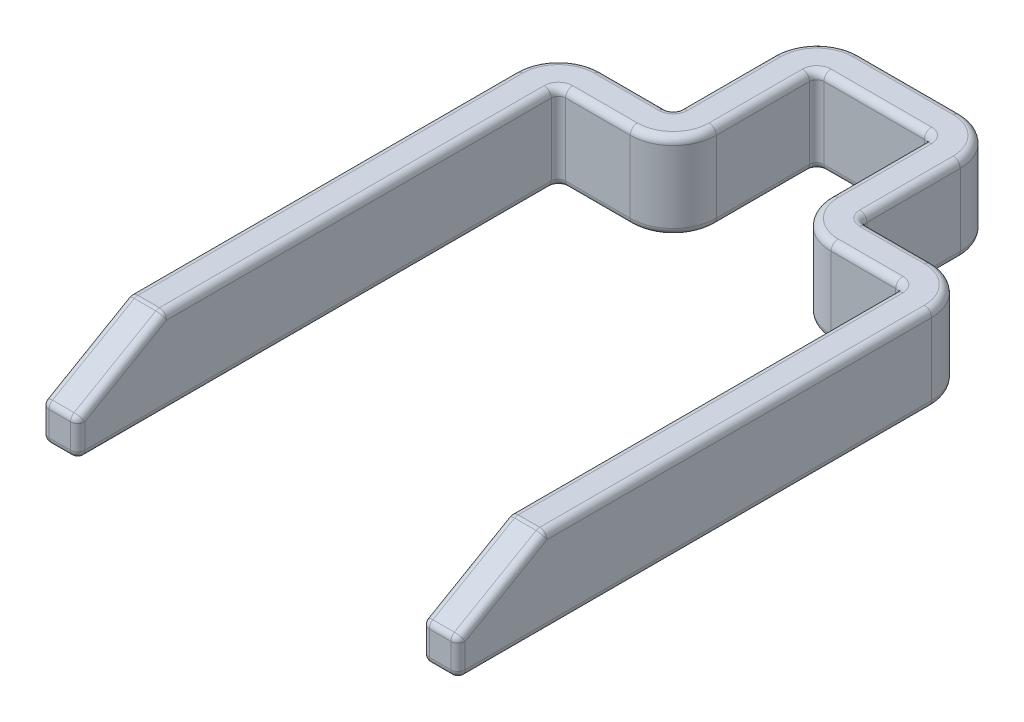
from build123d import *

# Parameters (mm, degrees)
BASE_EXTRU_MINCE_DEPTH       = 3
ENL_V_MAT_EXTRU_1_DEPTH      = 28.775888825
ENL_V_MAT_EXTRU_1_DEPTH_BACK = 28.775888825
CONG_1_R                     = 0.5


with BuildPart() as part:
    # Esquisse1 → Base-Extru.-Mince (new, symmetric)
    with BuildSketch(Plane(origin=(0, 0, 0), x_dir=(1, 0, 0), z_dir=(0, 1, 0))):
        with BuildLine():
            Line((-12, -23.5), (-12, 9.5))
            ThreePointArc((-12, 9.5), (-11.853553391, 9.853553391), (-11.5, 10))
            Line((-11.5, 10), (-7, 10))
            ThreePointArc((-7, 10), (-4.878679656, 10.878679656), (-4, 13))
            Line((-4, 13), (-4, 19.5))
            ThreePointArc((-4, 19.5), (-3.853553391, 19.853553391), (-3.5, 20))
            Line((-3.5, 20), (3.5, 20))
            ThreePointArc((3.5, 20), (3.853553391, 19.853553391), (4, 19.5))
            Line((4, 19.5), (4, 13))
            ThreePointArc((4, 13), (4.878679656, 10.878679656), (7, 10))
            Line((7, 10), (11.5, 10))
            ThreePointArc((11.5, 10), (11.853553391, 9.853553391), (12, 9.5))
            Line((12, 9.5), (12, -23.5))
            Line((12, -23.5), (14.5, -23.5))
            Line((14.5, -23.5), (14.5, 9.5))
            ThreePointArc((14.5, 9.5), (13.621320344, 11.621320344), (11.5, 12.5))
            Line((11.5, 12.5), (7, 12.5))
            ThreePointArc((7, 12.5), (6.646446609, 12.646446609), (6.5, 13))
            Line((6.5, 13), (6.5, 19.5))
            ThreePointArc((6.5, 19.5), (5.621320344, 21.621320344), (3.5, 22.5))
            Line((3.5, 22.5), (-3.5, 22.5))
            ThreePointArc((-3.5, 22.5), (-5.621320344, 21.621320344), (-6.5, 19.5))
            Line((-6.5, 19.5), (-6.5, 13))
            ThreePointArc((-6.5, 13), (-6.646446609, 12.646446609), (-7, 12.5))
            Line((-7, 12.5), (-11.5, 12.5))
            ThreePointArc((-11.5, 12.5), (-13.621320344, 11.621320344), (-14.5, 9.5))
            Line((-14.5, 9.5), (-14.5, -23.5))
            Line((-14.5, -23.5), (-12, -23.5))
        make_face()
    extrude(amount=BASE_EXTRU_MINCE_DEPTH, both=True)

    # Esquisse2 → Enl_v. mat.-Extru.1 (cut, two sides: drawn at the far end of the back side and taken through both)
    with BuildSketch(Plane(origin=(0, 0, 0), x_dir=(0, 0, -1), z_dir=(1, 0, 0)).offset(-ENL_V_MAT_EXTRU_1_DEPTH_BACK)):
        Polygon((-23.5, 3), (-23.5, -0.5), (-17.437822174, 3), align=None)
    extrude(amount=ENL_V_MAT_EXTRU_1_DEPTH + ENL_V_MAT_EXTRU_1_DEPTH_BACK, mode=Mode.SUBTRACT)

    # Cong_1
    cong_1_edges = [part.edges().sort_by_distance(p)[0] for p in [
        (-13.621320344, -3, -11.621320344),
        (-13.621320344, 3, -11.621320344),
        (-14.5, -3, 7),
        (-13.25, -3, 23.5),
        (-12, -3, 7),
        (-11.853553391, -3, -9.853553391),
        (-9.25, -3, -10),
        (-4.878679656, -3, -10.878679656),
        (-4, -3, -16.25),
        (-3.853553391, -3, -19.853553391),
        (0, -3, -20),
        (3.853553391, -3, -19.853553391),
        (4, -3, -16.25),
        (4.878679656, -3, -10.878679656),
        (9.25, -3, -10),
        (11.853553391, -3, -9.853553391),
        (12, -3, 7),
        (13.25, -3, 23.5),
        (14.5, -3, 7),
        (13.621320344, -3, -11.621320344),
        (9.25, -3, -12.5),
        (6.646446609, -3, -12.646446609),
        (6.5, -3, -16.25),
        (5.621320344, -3, -21.621320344),
        (0, -3, -22.5),
        (-5.621320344, -3, -21.621320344),
        (-6.5, -3, -16.25),
        (-6.646446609, -3, -12.646446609),
        (-9.25, -3, -12.5),
        (-14.5, 3, 3.968911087),
        (-14.5, 1.25, 20.468911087),
        (-14.5, -1.75, 23.5),
        (-9.25, 3, -12.5),
        (-6.646446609, 3, -12.646446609),
        (-6.5, 3, -16.25),
        (-5.621320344, 3, -21.621320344),
        (0, 3, -22.5),
        (5.621320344, 3, -21.621320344),
        (6.5, 3, -16.25),
        (6.646446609, 3, -12.646446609),
        (9.25, 3, -12.5),
        (13.621320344, 3, -11.621320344),
        (14.5, 3, 3.968911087),
        (13.25, 3, 17.437822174),
        (12, 3, 3.968911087),
        (11.853553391, 3, -9.853553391),
        (9.25, 3, -10),
        (4.878679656, 3, -10.878679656),
        (4, 3, -16.25),
        (3.853553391, 3, -19.853553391),
        (0, 3, -20),
        (-3.853553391, 3, -19.853553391),
        (-4, 3, -16.25),
        (-4.878679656, 3, -10.878679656),
        (-9.25, 3, -10),
        (-11.853553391, 3, -9.853553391),
        (-12, 3, 3.968911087),
        (-13.25, 3, 17.437822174),
        (-13.25, -0.5, 23.5),
        (-12, -1.75, 23.5),
        (-12, 1.25, 20.468911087),
        (12, 1.25, 20.468911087),
        (12, -1.75, 23.5),
        (13.25, -0.5, 23.5),
        (14.5, -1.75, 23.5),
        (14.5, 1.25, 20.468911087),
    ]]
    fillet(cong_1_edges, radius=CONG_1_R)


solid = part.part
